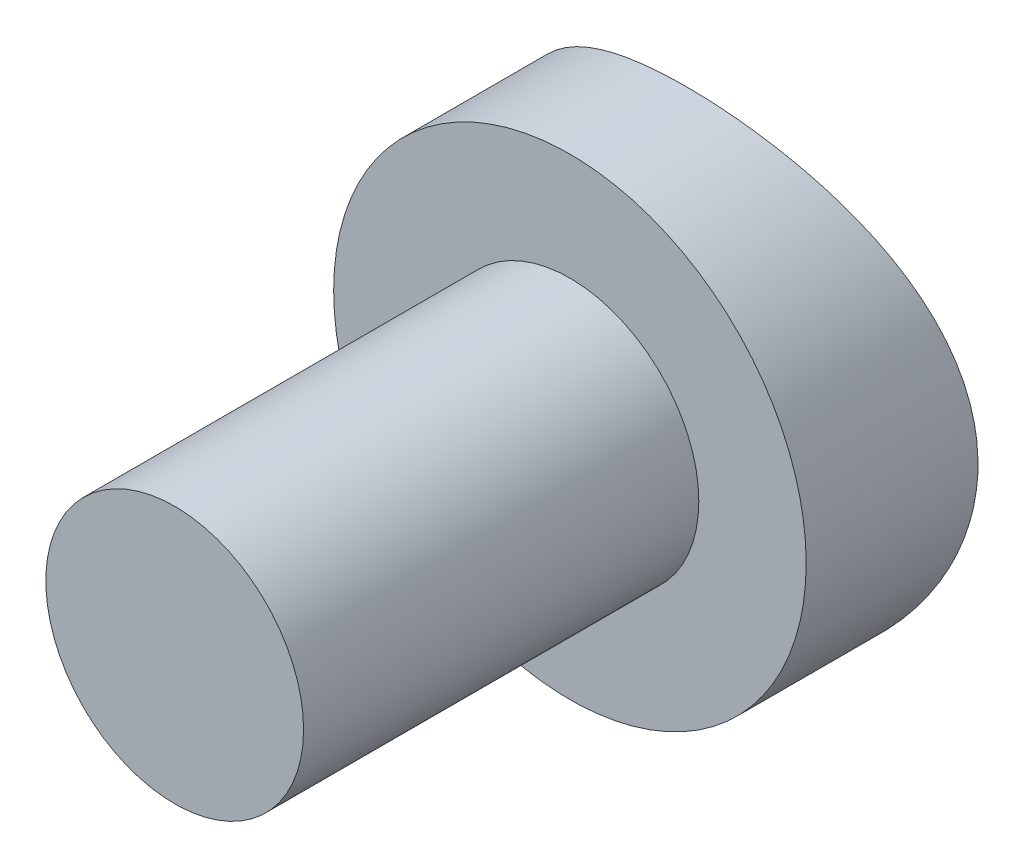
ISO-10303-21;
HEADER;
FILE_DESCRIPTION(('STEP AP214'),'2;1');
FILE_NAME('part.step','',(''),(''),'','','');
FILE_SCHEMA(('AUTOMOTIVE_DESIGN { 1 0 10303 214 1 1 1 1 }'));
ENDSEC;
DATA;
#1=APPLICATION_CONTEXT('core data for automotive mechanical design processes');
#2=APPLICATION_PROTOCOL_DEFINITION('international standard','automotive_design',2000,#1);
#3=PRODUCT_CONTEXT('',#1,'mechanical');
#4=PRODUCT('Part','Part','',(#3));
#5=PRODUCT_RELATED_PRODUCT_CATEGORY('part','',(#4));
#6=PRODUCT_DEFINITION_FORMATION('','',#4);
#7=PRODUCT_DEFINITION_CONTEXT('part definition',#1,'design');
#8=PRODUCT_DEFINITION('design','',#6,#7);
#9=PRODUCT_DEFINITION_SHAPE('','',#8);
#10=(LENGTH_UNIT() NAMED_UNIT(*) SI_UNIT(.MILLI.,.METRE.));
#11=(NAMED_UNIT(*) PLANE_ANGLE_UNIT() SI_UNIT($,.RADIAN.));
#12=(NAMED_UNIT(*) SI_UNIT($,.STERADIAN.) SOLID_ANGLE_UNIT());
#13=UNCERTAINTY_MEASURE_WITH_UNIT(LENGTH_MEASURE(1.E-05),#10,'distance_accuracy_value','');
#14=(GEOMETRIC_REPRESENTATION_CONTEXT(3) GLOBAL_UNCERTAINTY_ASSIGNED_CONTEXT((#13)) GLOBAL_UNIT_ASSIGNED_CONTEXT((#10,
#11,#12)) REPRESENTATION_CONTEXT('',''));
#15=CARTESIAN_POINT('',(0.,0.,0.));
#16=DIRECTION('',(0.,0.,1.));
#17=DIRECTION('',(1.,0.,0.));
#18=AXIS2_PLACEMENT_3D('',#15,#16,#17);
#19=CARTESIAN_POINT('',(-12.7,0.,7.874));
#20=DIRECTION('',(1.,0.,0.));
#21=DIRECTION('',(0.,0.,-1.));
#22=AXIS2_PLACEMENT_3D('',#19,#20,#21);
#23=CYLINDRICAL_SURFACE('',#22,7.874);
#24=CARTESIAN_POINT('',(-3.4925,0.,0.));
#25=CARTESIAN_POINT('',(-3.49249926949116,-0.0930440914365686,5.99659752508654E-07));
#26=CARTESIAN_POINT('',(-3.48877672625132,-0.186112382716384,0.00165367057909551));
#27=CARTESIAN_POINT('',(-3.47392437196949,-0.371577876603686,0.00822428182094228));
#28=CARTESIAN_POINT('',(-3.46279031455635,-0.463974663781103,0.0131436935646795));
#29=CARTESIAN_POINT('',(-3.43320394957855,-0.647550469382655,0.0261321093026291));
#30=CARTESIAN_POINT('',(-3.41473791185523,-0.738726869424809,0.0342070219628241));
#31=CARTESIAN_POINT('',(-3.37068962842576,-0.919042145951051,0.0532915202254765));
#32=CARTESIAN_POINT('',(-3.34510447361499,-1.00818017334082,0.0643023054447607));
#33=CARTESIAN_POINT('',(-3.25825042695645,-1.27091269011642,0.101244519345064));
#34=CARTESIAN_POINT('',(-3.18674106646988,-1.44069088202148,0.131150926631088));
#35=CARTESIAN_POINT('',(-3.01891299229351,-1.76556591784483,0.198696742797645));
#36=CARTESIAN_POINT('',(-2.92259999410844,-1.92066613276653,0.236334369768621));
#37=CARTESIAN_POINT('',(-2.70224908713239,-2.22075623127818,0.317976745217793));
#38=CARTESIAN_POINT('',(-2.57705426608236,-2.36483651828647,0.362207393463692));
#39=CARTESIAN_POINT('',(-2.30499740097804,-2.63074118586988,0.451144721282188));
#40=CARTESIAN_POINT('',(-2.1581225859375,-2.75255235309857,0.495851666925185));
#41=CARTESIAN_POINT('',(-1.83651438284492,-2.97747465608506,0.583598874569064));
#42=CARTESIAN_POINT('',(-1.66066529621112,-3.07910948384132,0.62639583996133));
#43=CARTESIAN_POINT('',(-1.38456101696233,-3.20794435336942,0.682952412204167));
#44=CARTESIAN_POINT('',(-1.29043390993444,-3.24696317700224,0.700536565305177));
#45=CARTESIAN_POINT('',(-1.0986682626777,-3.31675648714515,0.732538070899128));
#46=CARTESIAN_POINT('',(-1.00103163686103,-3.3475353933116,0.746957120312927));
#47=CARTESIAN_POINT('',(-0.808138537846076,-3.39910497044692,0.771413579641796));
#48=CARTESIAN_POINT('',(-0.713022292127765,-3.42033179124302,0.781639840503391));
#49=CARTESIAN_POINT('',(-0.521069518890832,-3.45478583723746,0.798358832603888));
#50=CARTESIAN_POINT('',(-0.42423384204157,-3.46801691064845,0.80485335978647));
#51=CARTESIAN_POINT('',(-0.229635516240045,-3.4863112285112,0.813857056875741));
#52=CARTESIAN_POINT('',(-0.131873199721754,-3.4913772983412,0.816367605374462));
#53=CARTESIAN_POINT('',(0.0637211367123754,-3.49329021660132,0.817316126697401));
#54=CARTESIAN_POINT('',(0.161553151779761,-3.49013758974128,0.815754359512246));
#55=CARTESIAN_POINT('',(0.436491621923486,-3.46966986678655,0.805649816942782));
#56=CARTESIAN_POINT('',(0.612827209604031,-3.44286207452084,0.792433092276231));
#57=CARTESIAN_POINT('',(0.958064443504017,-3.3632031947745,0.754264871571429));
#58=CARTESIAN_POINT('',(1.12696441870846,-3.31034628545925,0.729310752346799));
#59=CARTESIAN_POINT('',(1.45720302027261,-3.17905421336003,0.669919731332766));
#60=CARTESIAN_POINT('',(1.61828729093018,-3.10007225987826,0.635282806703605));
#61=CARTESIAN_POINT('',(1.92558680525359,-2.91916202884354,0.560455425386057));
#62=CARTESIAN_POINT('',(2.07179576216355,-2.81722410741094,0.520262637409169));
#63=CARTESIAN_POINT('',(2.3601314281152,-2.58171469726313,0.434120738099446));
#64=CARTESIAN_POINT('',(2.50048708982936,-2.44603410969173,0.387991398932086));
#65=CARTESIAN_POINT('',(2.7570913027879,-2.1526716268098,0.298421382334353));
#66=CARTESIAN_POINT('',(2.87333262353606,-1.99498315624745,0.254981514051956));
#67=CARTESIAN_POINT('',(3.08149410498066,-1.65608447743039,0.17410103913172));
#68=CARTESIAN_POINT('',(3.17260148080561,-1.47432028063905,0.136873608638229));
#69=CARTESIAN_POINT('',(3.32230690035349,-1.09596962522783,0.0742955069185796));
#70=CARTESIAN_POINT('',(3.3809253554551,-0.89939256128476,0.0489373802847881));
#71=CARTESIAN_POINT('',(3.46006864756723,-0.51171651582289,0.0144054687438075));
#72=CARTESIAN_POINT('',(3.48296476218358,-0.321191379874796,0.00422643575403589));
#73=CARTESIAN_POINT('',(3.4971963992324,0.061239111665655,-0.00208077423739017));
#74=CARTESIAN_POINT('',(3.4885425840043,0.253143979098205,0.00178630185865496));
#75=CARTESIAN_POINT('',(3.44153117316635,0.621167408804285,0.0224992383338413));
#76=CARTESIAN_POINT('',(3.40491982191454,0.797557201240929,0.038581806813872));
#77=CARTESIAN_POINT('',(3.30555565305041,1.14144870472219,0.0812461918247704));
#78=CARTESIAN_POINT('',(3.2427996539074,1.30894933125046,0.107829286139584));
#79=CARTESIAN_POINT('',(3.09092696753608,1.63624397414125,0.170026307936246));
#80=CARTESIAN_POINT('',(3.00104875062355,1.79563435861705,0.20589617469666));
#81=CARTESIAN_POINT('',(2.79831289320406,2.09764569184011,0.282946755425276));
#82=CARTESIAN_POINT('',(2.68544525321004,2.24025930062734,0.324129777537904));
#83=CARTESIAN_POINT('',(2.42937411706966,2.51674169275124,0.411522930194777));
#84=CARTESIAN_POINT('',(2.284462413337,2.64898863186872,0.457871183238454));
#85=CARTESIAN_POINT('',(1.97392592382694,2.88782938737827,0.547566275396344));
#86=CARTESIAN_POINT('',(1.80829392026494,2.99441422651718,0.590912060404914));
#87=CARTESIAN_POINT('',(1.45582406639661,3.18100302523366,0.670413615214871));
#88=CARTESIAN_POINT('',(1.26858399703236,3.26033435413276,0.706379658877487));
#89=CARTESIAN_POINT('',(0.881286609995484,3.38558781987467,0.764673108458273));
#90=CARTESIAN_POINT('',(0.681241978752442,3.43154248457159,0.787013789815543));
#91=CARTESIAN_POINT('',(0.292219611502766,3.48531337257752,0.813314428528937));
#92=CARTESIAN_POINT('',(0.103735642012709,3.49602490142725,0.8186683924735));
#93=CARTESIAN_POINT('',(-0.272289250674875,3.48694113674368,0.814173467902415));
#94=CARTESIAN_POINT('',(-0.459830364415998,3.46715227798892,0.804327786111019));
#95=CARTESIAN_POINT('',(-0.817019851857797,3.40016144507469,0.771886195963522));
#96=CARTESIAN_POINT('',(-0.987068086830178,3.35466604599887,0.750086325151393));
#97=CARTESIAN_POINT('',(-1.31709901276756,3.23934934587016,0.696918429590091));
#98=CARTESIAN_POINT('',(-1.47707878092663,3.16952101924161,0.665547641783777));
#99=CARTESIAN_POINT('',(-1.79363961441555,3.00241146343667,0.594292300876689));
#100=CARTESIAN_POINT('',(-1.94934854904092,2.90365977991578,0.553991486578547));
#101=CARTESIAN_POINT('',(-2.2428872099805,2.68341318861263,0.470417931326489));
#102=CARTESIAN_POINT('',(-2.38070946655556,2.56190883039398,0.427143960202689));
#103=CARTESIAN_POINT('',(-2.64693048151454,2.28714438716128,0.337988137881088));
#104=CARTESIAN_POINT('',(-2.77346695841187,2.13204145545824,0.292206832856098));
#105=CARTESIAN_POINT('',(-2.99894701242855,1.80108222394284,0.206857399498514));
#106=CARTESIAN_POINT('',(-3.09787799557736,1.62521650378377,0.167292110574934));
#107=CARTESIAN_POINT('',(-3.22235510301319,1.35055024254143,0.116132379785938));
#108=CARTESIAN_POINT('',(-3.25972721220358,1.25769518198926,0.100504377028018));
#109=CARTESIAN_POINT('',(-3.32647112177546,1.06872191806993,0.072281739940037));
#110=CARTESIAN_POINT('',(-3.35584677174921,0.972605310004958,0.0596856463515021));
#111=CARTESIAN_POINT('',(-3.40620477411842,0.778075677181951,0.0379271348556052));
#112=CARTESIAN_POINT('',(-3.42720720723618,0.67966875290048,0.0287565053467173));
#113=CARTESIAN_POINT('',(-3.46065419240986,0.481188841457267,0.0140878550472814));
#114=CARTESIAN_POINT('',(-3.47310470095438,0.3811170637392,0.00858727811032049));
#115=CARTESIAN_POINT('',(-3.48496706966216,0.233998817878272,0.00333887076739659));
#116=CARTESIAN_POINT('',(-3.48779080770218,0.187255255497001,0.00208779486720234));
#117=CARTESIAN_POINT('',(-3.49155746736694,0.0936765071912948,0.000418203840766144));
#118=CARTESIAN_POINT('',(-3.49250036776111,0.0468413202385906,-3.01887568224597E-07));
#119=CARTESIAN_POINT('',(-3.4925,0.,0.));
#120=B_SPLINE_CURVE_WITH_KNOTS('',3,(#24,#25,#26,#27,#28,#29,#30,#31,#32,#33,#34,#35,#36,#37,
#38,#39,#40,#41,#42,#43,#44,#45,#46,#47,#48,#49,#50,#51,#52,#53,#54,#55,#56,#57,#58,#59,#60,#61,
#62,#63,#64,#65,#66,#67,#68,#69,#70,#71,#72,#73,#74,#75,#76,#77,#78,#79,#80,#81,#82,#83,#84,#85,
#86,#87,#88,#89,#90,#91,#92,#93,#94,#95,#96,#97,#98,#99,#100,#101,#102,#103,#104,#105,#106,#107,
#108,#109,#110,#111,#112,#113,#114,#115,#116,#117,#118,#119),.UNSPECIFIED.,.T.,.F.,(4,2,2,2,2,2,
2,2,2,2,2,2,2,2,2,2,2,2,2,2,2,2,2,2,2,2,2,2,2,2,2,2,2,2,2,2,2,2,2,2,2,2,2,2,2,2,2,4),(0.,
0.279084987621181,0.558330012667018,0.838100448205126,1.11798537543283,1.67515091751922,
2.23218818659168,2.81743099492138,3.40301993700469,4.02225012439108,4.33209537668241,
4.64177410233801,4.93535009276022,5.22878467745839,5.52211770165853,5.81543199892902,
6.34924111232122,6.88316958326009,7.42906631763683,7.97519281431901,8.57428329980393,
9.1735531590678,9.79038899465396,10.4068368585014,10.9802992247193,11.5535678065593,
12.0936929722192,12.6338838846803,13.1909327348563,13.748224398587,14.3502674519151,
14.9525208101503,15.5687194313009,16.1843167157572,16.7478811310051,17.3113266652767,
17.8411442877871,18.3711150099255,18.9349891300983,19.4990979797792,20.1122718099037,
20.7257249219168,21.0293034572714,21.3327355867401,21.635435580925,21.9379245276,
22.078423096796,22.2189232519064),.UNSPECIFIED.);
#121=CARTESIAN_POINT('',(-3.4925,0.,0.));
#122=VERTEX_POINT('',#121);
#123=EDGE_CURVE('E81',#122,#122,#120,.T.);
#124=ORIENTED_EDGE('',*,*,#123,.F.);
#125=EDGE_LOOP('',(#124));
#126=FACE_BOUND('',#125,.T.);
#127=CARTESIAN_POINT('',(-0.4318,0.,7.874));
#128=DIRECTION('',(1.,0.,0.));
#129=DIRECTION('',(0.,0.,-1.));
#130=AXIS2_PLACEMENT_3D('',#127,#128,#129);
#131=CIRCLE('',#130,7.874);
#132=CARTESIAN_POINT('',(-0.4318,-3.4559150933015,0.798936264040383));
#133=VERTEX_POINT('',#132);
#134=CARTESIAN_POINT('',(-0.4318,3.4559150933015,0.798936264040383));
#135=VERTEX_POINT('',#134);
#136=EDGE_CURVE('E11',#133,#135,#131,.T.);
#137=ORIENTED_EDGE('',*,*,#136,.F.);
#138=DIRECTION('',(1.,0.,0.));
#139=VECTOR('',#138,1.);
#140=CARTESIAN_POINT('',(0.,-3.4559150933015,0.798936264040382));
#141=LINE('',#140,#139);
#142=CARTESIAN_POINT('',(0.4318,-3.4559150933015,0.798936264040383));
#143=VERTEX_POINT('',#142);
#144=EDGE_CURVE('E55',#133,#143,#141,.T.);
#145=ORIENTED_EDGE('',*,*,#144,.T.);
#146=CARTESIAN_POINT('',(0.4318,0.,7.874));
#147=DIRECTION('',(1.,0.,0.));
#148=DIRECTION('',(0.,0.,-1.));
#149=AXIS2_PLACEMENT_3D('',#146,#147,#148);
#150=CIRCLE('',#149,7.874);
#151=CARTESIAN_POINT('',(0.4318,3.4559150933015,0.798936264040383));
#152=VERTEX_POINT('',#151);
#153=EDGE_CURVE('E61',#143,#152,#150,.T.);
#154=ORIENTED_EDGE('',*,*,#153,.T.);
#155=DIRECTION('',(1.,0.,0.));
#156=VECTOR('',#155,1.);
#157=CARTESIAN_POINT('',(0.,3.4559150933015,0.798936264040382));
#158=LINE('',#157,#156);
#159=EDGE_CURVE('E42',#152,#135,#158,.F.);
#160=ORIENTED_EDGE('',*,*,#159,.T.);
#161=EDGE_LOOP('',(#137,#145,#154,#160));
#162=FACE_BOUND('',#161,.T.);
#163=ADVANCED_FACE('F34',(#126,#162),#23,.T.);
#164=CARTESIAN_POINT('',(0.,0.,8.382));
#165=DIRECTION('',(0.,0.,-1.));
#166=DIRECTION('',(-1.,0.,0.));
#167=AXIS2_PLACEMENT_3D('',#164,#165,#166);
#168=CYLINDRICAL_SURFACE('',#167,1.905);
#169=CARTESIAN_POINT('',(0.,0.,2.54));
#170=DIRECTION('',(0.,0.,1.));
#171=DIRECTION('',(1.,0.,0.));
#172=AXIS2_PLACEMENT_3D('',#169,#170,#171);
#173=CIRCLE('',#172,1.905);
#174=CARTESIAN_POINT('',(1.905,0.,2.54));
#175=VERTEX_POINT('',#174);
#176=EDGE_CURVE('E78',#175,#175,#173,.T.);
#177=ORIENTED_EDGE('',*,*,#176,.T.);
#178=EDGE_LOOP('',(#177));
#179=FACE_BOUND('',#178,.T.);
#180=CARTESIAN_POINT('',(0.,0.,8.382));
#181=DIRECTION('',(0.,0.,1.));
#182=DIRECTION('',(1.,0.,0.));
#183=AXIS2_PLACEMENT_3D('',#180,#181,#182);
#184=CIRCLE('',#183,1.905);
#185=CARTESIAN_POINT('',(1.905,0.,8.382));
#186=VERTEX_POINT('',#185);
#187=EDGE_CURVE('E65',#186,#186,#184,.T.);
#188=ORIENTED_EDGE('',*,*,#187,.F.);
#189=EDGE_LOOP('',(#188));
#190=FACE_BOUND('',#189,.T.);
#191=ADVANCED_FACE('F36',(#179,#190),#168,.T.);
#192=CARTESIAN_POINT('',(0.,-7.82492135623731,8.382));
#193=DIRECTION('',(0.,0.,1.));
#194=DIRECTION('',(1.,0.,0.));
#195=AXIS2_PLACEMENT_3D('',#192,#193,#194);
#196=PLANE('',#195);
#197=ORIENTED_EDGE('',*,*,#187,.T.);
#198=EDGE_LOOP('',(#197));
#199=FACE_BOUND('',#198,.T.);
#200=ADVANCED_FACE('F98',(#199),#196,.T.);
#201=CARTESIAN_POINT('',(0.,0.,2.54));
#202=DIRECTION('',(0.,0.,1.));
#203=DIRECTION('',(1.,0.,0.));
#204=AXIS2_PLACEMENT_3D('',#201,#202,#203);
#205=PLANE('',#204);
#206=CARTESIAN_POINT('',(0.,0.,2.54));
#207=DIRECTION('',(0.,0.,1.));
#208=DIRECTION('',(1.,0.,0.));
#209=AXIS2_PLACEMENT_3D('',#206,#207,#208);
#210=CIRCLE('',#209,3.4925);
#211=CARTESIAN_POINT('',(3.4925,0.,2.54));
#212=VERTEX_POINT('',#211);
#213=EDGE_CURVE('E75',#212,#212,#210,.T.);
#214=ORIENTED_EDGE('',*,*,#213,.T.);
#215=EDGE_LOOP('',(#214));
#216=FACE_BOUND('',#215,.T.);
#217=ORIENTED_EDGE('',*,*,#176,.F.);
#218=EDGE_LOOP('',(#217));
#219=FACE_BOUND('',#218,.T.);
#220=ADVANCED_FACE('F96',(#216,#219),#205,.T.);
#221=CARTESIAN_POINT('',(0.,0.,2.54));
#222=DIRECTION('',(0.,0.,-1.));
#223=DIRECTION('',(-1.,0.,0.));
#224=AXIS2_PLACEMENT_3D('',#221,#222,#223);
#225=CYLINDRICAL_SURFACE('',#224,3.4925);
#226=ORIENTED_EDGE('',*,*,#213,.F.);
#227=EDGE_LOOP('',(#226));
#228=FACE_BOUND('',#227,.T.);
#229=ORIENTED_EDGE('',*,*,#123,.T.);
#230=EDGE_LOOP('',(#229));
#231=FACE_BOUND('',#230,.T.);
#232=ADVANCED_FACE('F88',(#228,#231),#225,.T.);
#233=CARTESIAN_POINT('',(-0.4318,0.,-6.50159869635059));
#234=DIRECTION('',(1.,0.,0.));
#235=DIRECTION('',(0.,0.,-1.));
#236=AXIS2_PLACEMENT_3D('',#233,#234,#235);
#237=CYLINDRICAL_SURFACE('',#236,8.0772);
#238=CARTESIAN_POINT('',(0.4318,0.,-6.50159869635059));
#239=DIRECTION('',(1.,0.,0.));
#240=DIRECTION('',(0.,0.,-1.));
#241=AXIS2_PLACEMENT_3D('',#238,#239,#240);
#242=CIRCLE('',#241,8.0772);
#243=EDGE_CURVE('E48',#152,#143,#242,.T.);
#244=ORIENTED_EDGE('',*,*,#243,.T.);
#245=ORIENTED_EDGE('',*,*,#144,.F.);
#246=CARTESIAN_POINT('',(-0.4318,0.,-6.50159869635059));
#247=DIRECTION('',(1.,0.,0.));
#248=DIRECTION('',(0.,0.,-1.));
#249=AXIS2_PLACEMENT_3D('',#246,#247,#248);
#250=CIRCLE('',#249,8.0772);
#251=EDGE_CURVE('E68',#135,#133,#250,.T.);
#252=ORIENTED_EDGE('',*,*,#251,.F.);
#253=ORIENTED_EDGE('',*,*,#159,.F.);
#254=EDGE_LOOP('',(#244,#245,#252,#253));
#255=FACE_BOUND('',#254,.T.);
#256=ADVANCED_FACE('F67',(#255),#237,.F.);
#257=CARTESIAN_POINT('',(-0.4318,0.,-6.50159869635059));
#258=DIRECTION('',(1.,0.,0.));
#259=DIRECTION('',(0.,0.,-1.));
#260=AXIS2_PLACEMENT_3D('',#257,#258,#259);
#261=PLANE('',#260);
#262=ORIENTED_EDGE('',*,*,#136,.T.);
#263=ORIENTED_EDGE('',*,*,#251,.T.);
#264=EDGE_LOOP('',(#262,#263));
#265=FACE_BOUND('',#264,.T.);
#266=ADVANCED_FACE('F147',(#265),#261,.T.);
#267=CARTESIAN_POINT('',(0.4318,0.,-6.50159869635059));
#268=DIRECTION('',(1.,0.,0.));
#269=DIRECTION('',(0.,0.,-1.));
#270=AXIS2_PLACEMENT_3D('',#267,#268,#269);
#271=PLANE('',#270);
#272=ORIENTED_EDGE('',*,*,#243,.F.);
#273=ORIENTED_EDGE('',*,*,#153,.F.);
#274=EDGE_LOOP('',(#272,#273));
#275=FACE_BOUND('',#274,.T.);
#276=ADVANCED_FACE('F62',(#275),#271,.F.);
#277=CLOSED_SHELL('',(#163,#191,#200,#220,#232,#256,#266,#276));
#278=MANIFOLD_SOLID_BREP('B2',#277);
#279=ADVANCED_BREP_SHAPE_REPRESENTATION('',(#18,#278),#14);
#280=SHAPE_DEFINITION_REPRESENTATION(#9,#279);
ENDSEC;
END-ISO-10303-21;
